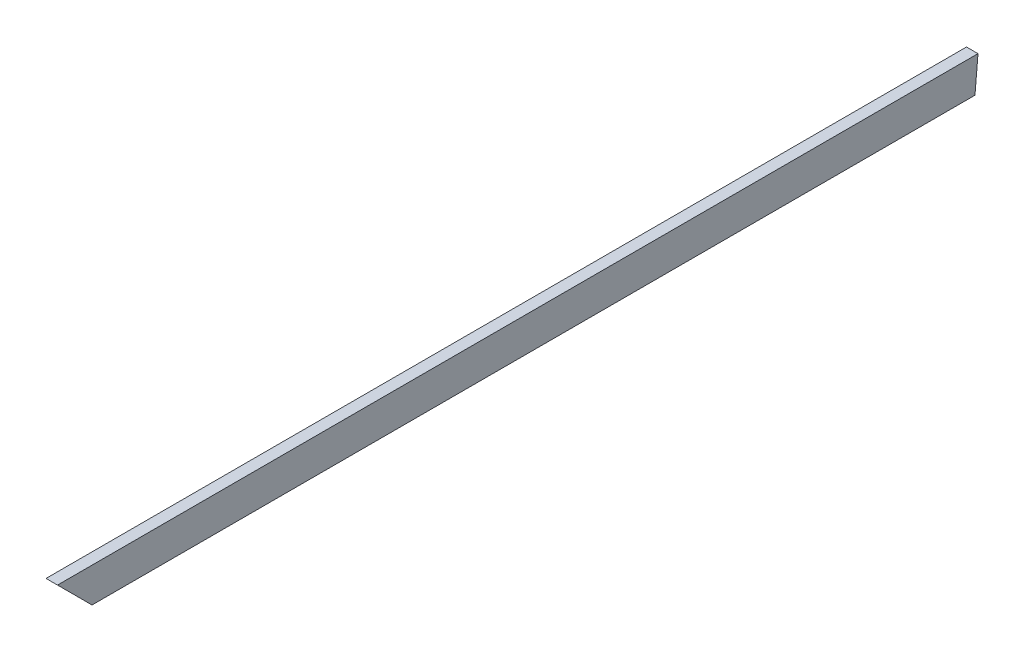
from build123d import *

# Parameters (mm, degrees)
SKIZZE1_W                       = 50
SKIZZE1_H                       = 150
AUFSATZ_LINEAR_AUSTRAGEN1_DEPTH = 2000
WANDUNG1_T                      = -4
SCHNITT_LINEAR_AUSTRAGEN1_DEPTH = 2007.240264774


with BuildPart() as part:
    # Skizze1 → Aufsatz-Linear austragen1 (new, symmetric)
    with BuildSketch(Plane.XY):
        with Locations((25, 75)):
            Rectangle(SKIZZE1_W, SKIZZE1_H)
    extrude(amount=AUFSATZ_LINEAR_AUSTRAGEN1_DEPTH, both=True)

    # Wandung1
    wandung1_openings = [part.faces().sort_by_distance(p)[0] for p in [
        (25, 75, 2000),
    ]]
    offset(amount=WANDUNG1_T, openings=wandung1_openings, kind=Kind.INTERSECTION)

    # Skizze2 → Schnitt-Linear austragen1 (cut, through all)
    with BuildSketch(Plane(origin=(50, 0, 0), x_dir=(0, 0, -1), z_dir=(1, 0, 0))):
        Polygon((-2000, 150), (-2000, 0), (-1850, 0), align=None)
        Polygon((2000, 0), (1986.876700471, 0), (2000, 150), align=None)
    extrude(amount=-SCHNITT_LINEAR_AUSTRAGEN1_DEPTH, mode=Mode.SUBTRACT)


solid = part.part
